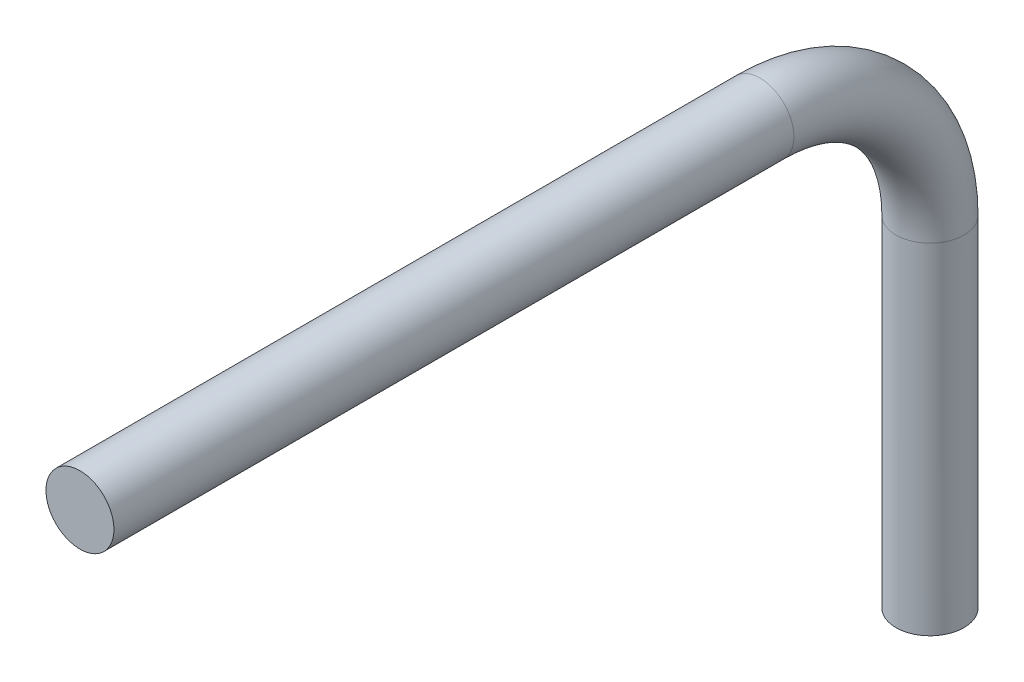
ISO-10303-21;
HEADER;
FILE_DESCRIPTION(('STEP AP214'),'2;1');
FILE_NAME('part.step','',(''),(''),'','','');
FILE_SCHEMA(('AUTOMOTIVE_DESIGN { 1 0 10303 214 1 1 1 1 }'));
ENDSEC;
DATA;
#1=APPLICATION_CONTEXT('core data for automotive mechanical design processes');
#2=APPLICATION_PROTOCOL_DEFINITION('international standard','automotive_design',2000,#1);
#3=PRODUCT_CONTEXT('',#1,'mechanical');
#4=PRODUCT('Part','Part','',(#3));
#5=PRODUCT_RELATED_PRODUCT_CATEGORY('part','',(#4));
#6=PRODUCT_DEFINITION_FORMATION('','',#4);
#7=PRODUCT_DEFINITION_CONTEXT('part definition',#1,'design');
#8=PRODUCT_DEFINITION('design','',#6,#7);
#9=PRODUCT_DEFINITION_SHAPE('','',#8);
#10=(LENGTH_UNIT() NAMED_UNIT(*) SI_UNIT(.MILLI.,.METRE.));
#11=(NAMED_UNIT(*) PLANE_ANGLE_UNIT() SI_UNIT($,.RADIAN.));
#12=(NAMED_UNIT(*) SI_UNIT($,.STERADIAN.) SOLID_ANGLE_UNIT());
#13=UNCERTAINTY_MEASURE_WITH_UNIT(LENGTH_MEASURE(1.E-05),#10,'distance_accuracy_value','');
#14=(GEOMETRIC_REPRESENTATION_CONTEXT(3) GLOBAL_UNCERTAINTY_ASSIGNED_CONTEXT((#13)) GLOBAL_UNIT_ASSIGNED_CONTEXT((#10,
#11,#12)) REPRESENTATION_CONTEXT('',''));
#15=CARTESIAN_POINT('',(0.,0.,0.));
#16=DIRECTION('',(0.,0.,1.));
#17=DIRECTION('',(1.,0.,0.));
#18=AXIS2_PLACEMENT_3D('',#15,#16,#17);
#19=CARTESIAN_POINT('',(0.,-25.,-125.));
#20=DIRECTION('',(0.,-1.,0.));
#21=DIRECTION('',(0.,0.,-1.));
#22=AXIS2_PLACEMENT_3D('',#19,#20,#21);
#23=CYLINDRICAL_SURFACE('',#22,5.);
#24=CARTESIAN_POINT('',(0.,-25.,-125.));
#25=DIRECTION('',(0.,1.,0.));
#26=DIRECTION('',(1.,0.,0.));
#27=AXIS2_PLACEMENT_3D('',#24,#25,#26);
#28=CIRCLE('',#27,5.);
#29=CARTESIAN_POINT('',(0.,-25.,-130.));
#30=VERTEX_POINT('',#29);
#31=EDGE_CURVE('E34',#30,#30,#28,.T.);
#32=ORIENTED_EDGE('',*,*,#31,.F.);
#33=EDGE_LOOP('',(#32));
#34=FACE_BOUND('',#33,.T.);
#35=CARTESIAN_POINT('',(0.,-75.,-125.));
#36=DIRECTION('',(0.,1.,0.));
#37=DIRECTION('',(1.,0.,0.));
#38=AXIS2_PLACEMENT_3D('',#35,#36,#37);
#39=CIRCLE('',#38,5.);
#40=CARTESIAN_POINT('',(5.,-75.,-125.));
#41=VERTEX_POINT('',#40);
#42=EDGE_CURVE('E10',#41,#41,#39,.T.);
#43=ORIENTED_EDGE('',*,*,#42,.T.);
#44=EDGE_LOOP('',(#43));
#45=FACE_BOUND('',#44,.T.);
#46=ADVANCED_FACE('F28',(#34,#45),#23,.T.);
#47=CARTESIAN_POINT('',(0.,-25.,-100.));
#48=DIRECTION('',(-1.,0.,0.));
#49=DIRECTION('',(0.,0.,1.));
#50=AXIS2_PLACEMENT_3D('',#47,#48,#49);
#51=TOROIDAL_SURFACE('',#50,25.,5.);
#52=CARTESIAN_POINT('',(0.,0.,-100.));
#53=DIRECTION('',(0.,0.,1.));
#54=DIRECTION('',(1.,0.,0.));
#55=AXIS2_PLACEMENT_3D('',#52,#53,#54);
#56=CIRCLE('',#55,5.);
#57=CARTESIAN_POINT('',(0.,5.,-100.));
#58=VERTEX_POINT('',#57);
#59=EDGE_CURVE('E38',#58,#58,#56,.T.);
#60=CARTESIAN_POINT('',(0.,-25.,-100.));
#61=DIRECTION('',(-1.,0.,0.));
#62=DIRECTION('',(0.,0.,1.));
#63=AXIS2_PLACEMENT_3D('',#60,#61,#62);
#64=CIRCLE('',#63,30.);
#65=EDGE_CURVE('',#58,#30,#64,.T.);
#66=ORIENTED_EDGE('',*,*,#59,.F.);
#67=ORIENTED_EDGE('',*,*,#31,.T.);
#68=ORIENTED_EDGE('',*,*,#65,.T.);
#69=ORIENTED_EDGE('',*,*,#65,.F.);
#70=EDGE_LOOP('',(#66,#68,#67,#69));
#71=FACE_BOUND('',#70,.T.);
#72=ADVANCED_FACE('F53',(#71),#51,.T.);
#73=CARTESIAN_POINT('',(0.,0.,-100.));
#74=DIRECTION('',(0.,0.,1.));
#75=DIRECTION('',(0.,-1.,0.));
#76=AXIS2_PLACEMENT_3D('',#73,#74,#75);
#77=CYLINDRICAL_SURFACE('',#76,5.);
#78=ORIENTED_EDGE('',*,*,#59,.T.);
#79=EDGE_LOOP('',(#78));
#80=FACE_BOUND('',#79,.T.);
#81=CARTESIAN_POINT('',(0.,0.,0.));
#82=DIRECTION('',(0.,0.,1.));
#83=DIRECTION('',(1.,0.,0.));
#84=AXIS2_PLACEMENT_3D('',#81,#82,#83);
#85=CIRCLE('',#84,5.);
#86=CARTESIAN_POINT('',(5.,0.,0.));
#87=VERTEX_POINT('',#86);
#88=EDGE_CURVE('E42',#87,#87,#85,.T.);
#89=ORIENTED_EDGE('',*,*,#88,.F.);
#90=EDGE_LOOP('',(#89));
#91=FACE_BOUND('',#90,.T.);
#92=ADVANCED_FACE('F50',(#80,#91),#77,.T.);
#93=CARTESIAN_POINT('',(0.,-75.,-125.));
#94=DIRECTION('',(0.,1.,0.));
#95=DIRECTION('',(1.,0.,0.));
#96=AXIS2_PLACEMENT_3D('',#93,#94,#95);
#97=PLANE('',#96);
#98=ORIENTED_EDGE('',*,*,#42,.F.);
#99=EDGE_LOOP('',(#98));
#100=FACE_BOUND('',#99,.T.);
#101=ADVANCED_FACE('F52',(#100),#97,.F.);
#102=CARTESIAN_POINT('',(0.,0.,0.));
#103=DIRECTION('',(0.,0.,1.));
#104=DIRECTION('',(1.,0.,0.));
#105=AXIS2_PLACEMENT_3D('',#102,#103,#104);
#106=PLANE('',#105);
#107=ORIENTED_EDGE('',*,*,#88,.T.);
#108=EDGE_LOOP('',(#107));
#109=FACE_BOUND('',#108,.T.);
#110=ADVANCED_FACE('F48',(#109),#106,.T.);
#111=CLOSED_SHELL('',(#46,#72,#92,#101,#110));
#112=MANIFOLD_SOLID_BREP('B2',#111);
#113=ADVANCED_BREP_SHAPE_REPRESENTATION('',(#18,#112),#14);
#114=SHAPE_DEFINITION_REPRESENTATION(#9,#113);
ENDSEC;
END-ISO-10303-21;
